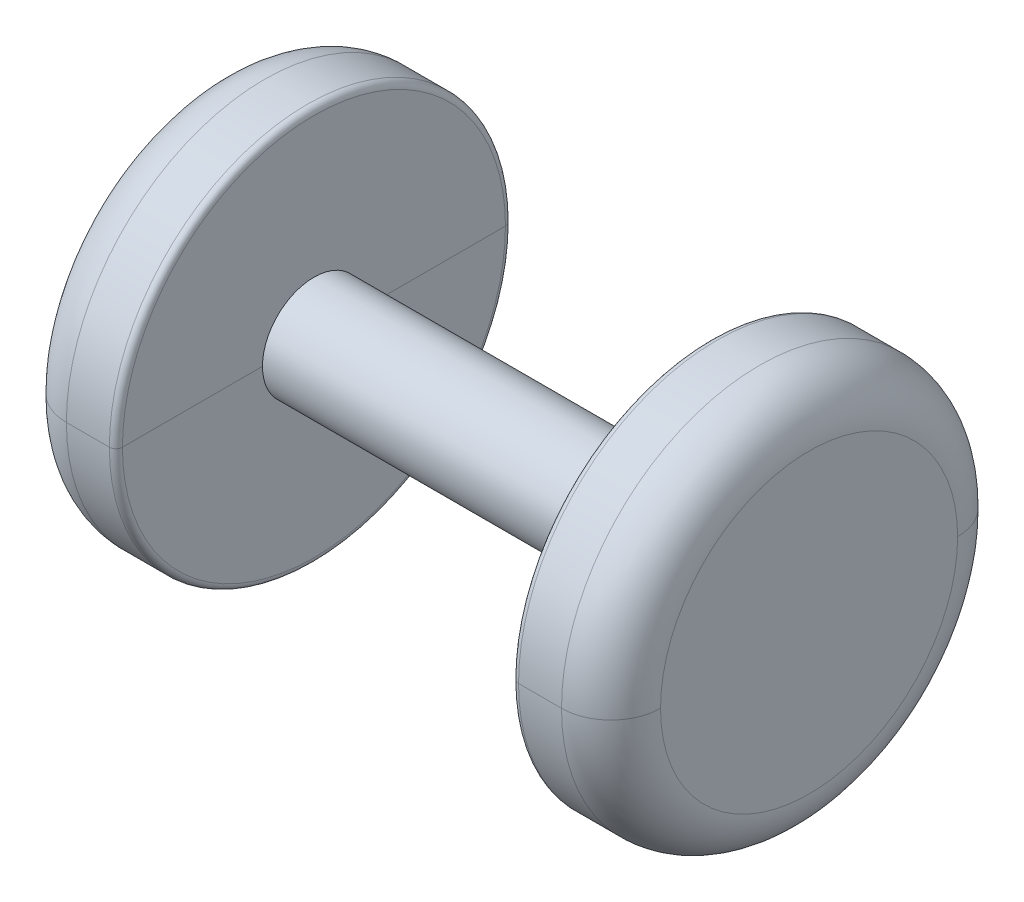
from build123d import *

# Parameters (mm, degrees)
SKETCH1_R           = 6.604
BOSS_EXTRUDE1_DEPTH = 38.1
SKETCH2_R           = 25.4
BOSS_EXTRUDE2_DEPTH = 12.7
BOSS_EXTRUDE3_START = -12.7
SKETCH3_R           = 25.4
BOSS_EXTRUDE3_DEPTH = 12.7
FILLET1_R           = 6.35
FILLET2_R           = 0.8382


with BuildPart() as part:
    # Sketch1 → Boss-Extrude1 (new, symmetric)
    with BuildSketch(Plane(origin=(0, 0, 0), x_dir=(0, 0, -1), z_dir=(1, 0, 0))):
        with Locations(Location((0, 0, 0), (0, 0, 180))):
            Circle(SKETCH1_R)
    extrude(amount=BOSS_EXTRUDE1_DEPTH, both=True)

    # Sketch2 → Boss-Extrude2 (add)
    with BuildSketch(Plane(origin=(38.1, 0, 0), x_dir=(0, 0, -1), z_dir=(1, 0, 0))):
        Circle(SKETCH2_R)
    extrude(amount=-BOSS_EXTRUDE2_DEPTH)

    # Sketch3 → Boss-Extrude3 (add)
    with BuildSketch(Plane.ZY.offset(38.1).offset(BOSS_EXTRUDE3_START)):
        with Locations(Location((0, 0, 0), (0, 0, 180))):
            Circle(SKETCH3_R)
    extrude(amount=BOSS_EXTRUDE3_DEPTH)

    # Fillet1
    fillet1_edges = [part.edges().sort_by_distance(p)[0] for p in [
        (-38.1, 0, 25.4),
        (38.1, 0, 25.4),
    ]]
    fillet(fillet1_edges, radius=FILLET1_R)

    # Fillet2
    fillet2_edges = [part.edges().sort_by_distance(p)[0] for p in [
        (-25.4, 0, 25.4),
        (25.4, 0, 25.4),
    ]]
    fillet(fillet2_edges, radius=FILLET2_R)


solid = part.part
